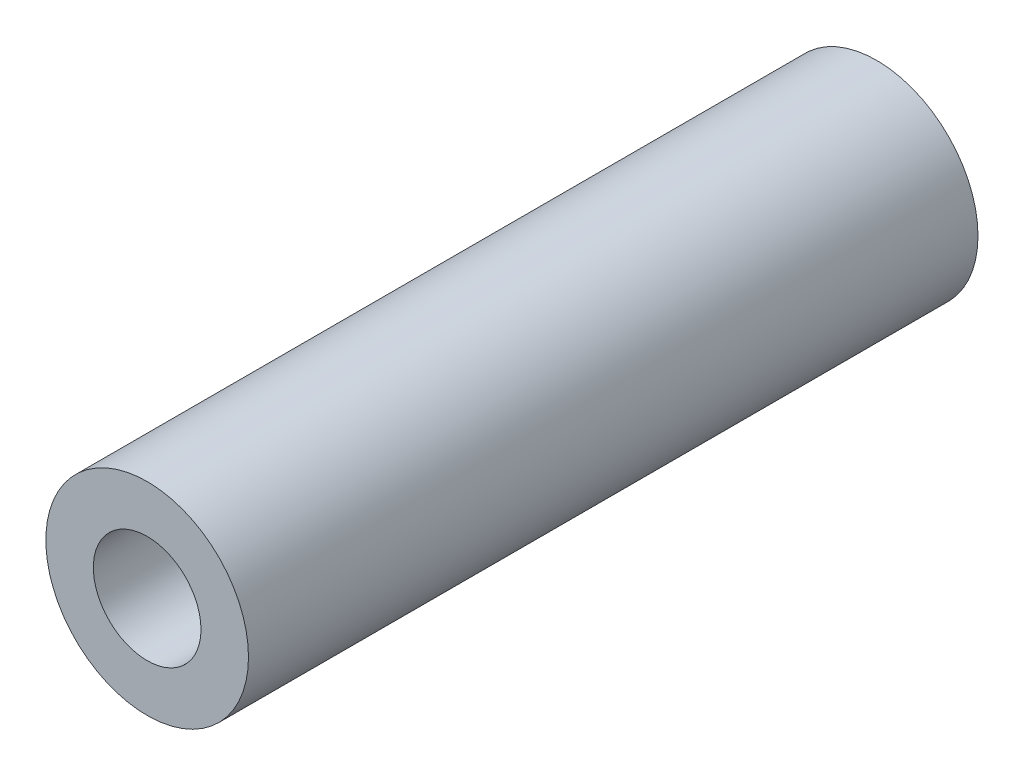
from build123d import *

# Parameters (mm, degrees)
SKETCH1_R      = 3.96875
SKETCH1_R_2    = 2.1082
EXTRUDE1_DEPTH = 14.2875


with BuildPart() as part:
    # Sketch1 → Extrude1 (new, symmetric)
    with BuildSketch(Plane.XY):
        Circle(SKETCH1_R)
        Circle(SKETCH1_R_2, mode=Mode.SUBTRACT)
    extrude(amount=EXTRUDE1_DEPTH, both=True)


solid = part.part
